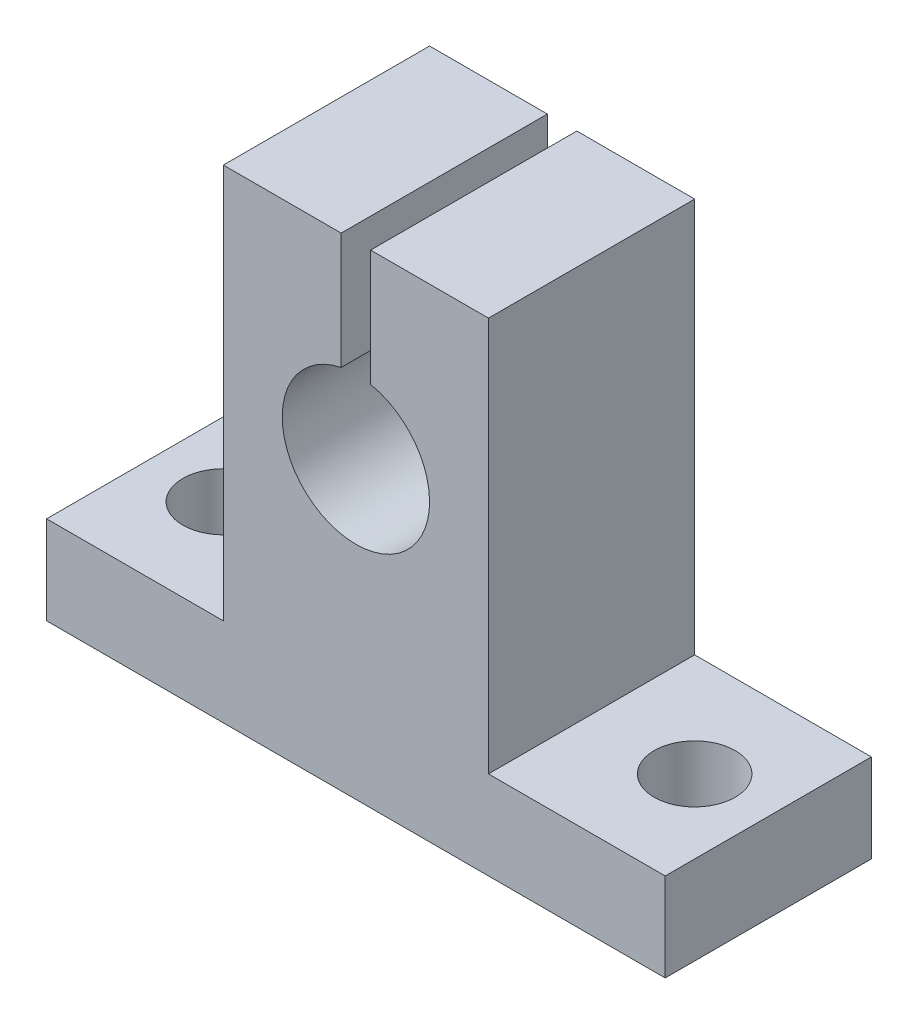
ISO-10303-21;
HEADER;
FILE_DESCRIPTION(('STEP AP214'),'2;1');
FILE_NAME('part.step','',(''),(''),'','','');
FILE_SCHEMA(('AUTOMOTIVE_DESIGN { 1 0 10303 214 1 1 1 1 }'));
ENDSEC;
DATA;
#1=APPLICATION_CONTEXT('core data for automotive mechanical design processes');
#2=APPLICATION_PROTOCOL_DEFINITION('international standard','automotive_design',2000,#1);
#3=PRODUCT_CONTEXT('',#1,'mechanical');
#4=PRODUCT('Part','Part','',(#3));
#5=PRODUCT_RELATED_PRODUCT_CATEGORY('part','',(#4));
#6=PRODUCT_DEFINITION_FORMATION('','',#4);
#7=PRODUCT_DEFINITION_CONTEXT('part definition',#1,'design');
#8=PRODUCT_DEFINITION('design','',#6,#7);
#9=PRODUCT_DEFINITION_SHAPE('','',#8);
#10=(LENGTH_UNIT() NAMED_UNIT(*) SI_UNIT(.MILLI.,.METRE.));
#11=(NAMED_UNIT(*) PLANE_ANGLE_UNIT() SI_UNIT($,.RADIAN.));
#12=(NAMED_UNIT(*) SI_UNIT($,.STERADIAN.) SOLID_ANGLE_UNIT());
#13=UNCERTAINTY_MEASURE_WITH_UNIT(LENGTH_MEASURE(1.E-05),#10,'distance_accuracy_value','');
#14=(GEOMETRIC_REPRESENTATION_CONTEXT(3) GLOBAL_UNCERTAINTY_ASSIGNED_CONTEXT((#13)) GLOBAL_UNIT_ASSIGNED_CONTEXT((#10,
#11,#12)) REPRESENTATION_CONTEXT('',''));
#15=CARTESIAN_POINT('',(0.,0.,0.));
#16=DIRECTION('',(0.,0.,1.));
#17=DIRECTION('',(1.,0.,0.));
#18=AXIS2_PLACEMENT_3D('',#15,#16,#17);
#19=CARTESIAN_POINT('',(21.,12.8,-7.));
#20=DIRECTION('',(0.,1.,0.));
#21=DIRECTION('',(-1.,0.,0.));
#22=AXIS2_PLACEMENT_3D('',#19,#20,#21);
#23=PLANE('',#22);
#24=DIRECTION('',(0.,0.,-1.));
#25=VECTOR('',#24,1.);
#26=CARTESIAN_POINT('',(-1.,12.8,7.));
#27=LINE('',#26,#25);
#28=CARTESIAN_POINT('',(-1.,12.8,7.));
#29=VERTEX_POINT('',#28);
#30=CARTESIAN_POINT('',(-1.,12.8,-7.));
#31=VERTEX_POINT('',#30);
#32=EDGE_CURVE('E141',#29,#31,#27,.T.);
#33=ORIENTED_EDGE('',*,*,#32,.T.);
#34=DIRECTION('',(-1.,0.,0.));
#35=VECTOR('',#34,1.);
#36=CARTESIAN_POINT('',(21.,12.8,-7.));
#37=LINE('',#36,#35);
#38=CARTESIAN_POINT('',(-9.,12.8,-7.));
#39=VERTEX_POINT('',#38);
#40=EDGE_CURVE('E193',#31,#39,#37,.T.);
#41=ORIENTED_EDGE('',*,*,#40,.T.);
#42=DIRECTION('',(0.,0.,-1.));
#43=VECTOR('',#42,1.);
#44=CARTESIAN_POINT('',(-9.,12.8,7.));
#45=LINE('',#44,#43);
#46=CARTESIAN_POINT('',(-9.,12.8,7.));
#47=VERTEX_POINT('',#46);
#48=EDGE_CURVE('E178',#47,#39,#45,.T.);
#49=ORIENTED_EDGE('',*,*,#48,.F.);
#50=DIRECTION('',(-1.,0.,0.));
#51=VECTOR('',#50,1.);
#52=CARTESIAN_POINT('',(21.,12.8,7.));
#53=LINE('',#52,#51);
#54=EDGE_CURVE('E205',#29,#47,#53,.T.);
#55=ORIENTED_EDGE('',*,*,#54,.F.);
#56=EDGE_LOOP('',(#33,#41,#49,#55));
#57=FACE_BOUND('',#56,.T.);
#58=ADVANCED_FACE('F32',(#57),#23,.T.);
#59=CARTESIAN_POINT('',(21.,-20.,-7.));
#60=DIRECTION('',(1.,0.,0.));
#61=DIRECTION('',(0.,1.,0.));
#62=AXIS2_PLACEMENT_3D('',#59,#60,#61);
#63=PLANE('',#62);
#64=DIRECTION('',(0.,0.,-1.));
#65=VECTOR('',#64,1.);
#66=CARTESIAN_POINT('',(21.,-14.,7.));
#67=LINE('',#66,#65);
#68=CARTESIAN_POINT('',(21.,-14.,7.));
#69=VERTEX_POINT('',#68);
#70=CARTESIAN_POINT('',(21.,-14.,-7.));
#71=VERTEX_POINT('',#70);
#72=EDGE_CURVE('E160',#69,#71,#67,.T.);
#73=ORIENTED_EDGE('',*,*,#72,.F.);
#74=DIRECTION('',(0.,1.,0.));
#75=VECTOR('',#74,1.);
#76=CARTESIAN_POINT('',(21.,-20.,7.));
#77=LINE('',#76,#75);
#78=CARTESIAN_POINT('',(21.,-20.,7.));
#79=VERTEX_POINT('',#78);
#80=EDGE_CURVE('E185',#79,#69,#77,.T.);
#81=ORIENTED_EDGE('',*,*,#80,.F.);
#82=DIRECTION('',(0.,0.,1.));
#83=VECTOR('',#82,1.);
#84=CARTESIAN_POINT('',(21.,-20.,-7.));
#85=LINE('',#84,#83);
#86=CARTESIAN_POINT('',(21.,-20.,-7.));
#87=VERTEX_POINT('',#86);
#88=EDGE_CURVE('E11',#87,#79,#85,.T.);
#89=ORIENTED_EDGE('',*,*,#88,.F.);
#90=DIRECTION('',(0.,1.,0.));
#91=VECTOR('',#90,1.);
#92=CARTESIAN_POINT('',(21.,-20.,-7.));
#93=LINE('',#92,#91);
#94=EDGE_CURVE('E190',#87,#71,#93,.T.);
#95=ORIENTED_EDGE('',*,*,#94,.T.);
#96=EDGE_LOOP('',(#73,#81,#89,#95));
#97=FACE_BOUND('',#96,.T.);
#98=ADVANCED_FACE('F34',(#97),#63,.T.);
#99=CARTESIAN_POINT('',(-21.,-20.,-7.));
#100=DIRECTION('',(0.,-1.,0.));
#101=DIRECTION('',(1.,0.,0.));
#102=AXIS2_PLACEMENT_3D('',#99,#100,#101);
#103=PLANE('',#102);
#104=CARTESIAN_POINT('',(-16.,-20.,0.));
#105=DIRECTION('',(0.,1.,0.));
#106=DIRECTION('',(0.,0.,1.));
#107=AXIS2_PLACEMENT_3D('',#104,#105,#106);
#108=CIRCLE('',#107,2.74999999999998);
#109=CARTESIAN_POINT('',(-16.,-20.,2.74999999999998));
#110=VERTEX_POINT('',#109);
#111=EDGE_CURVE('E298',#110,#110,#108,.T.);
#112=ORIENTED_EDGE('',*,*,#111,.T.);
#113=EDGE_LOOP('',(#112));
#114=FACE_BOUND('',#113,.T.);
#115=CARTESIAN_POINT('',(16.,-20.,0.));
#116=DIRECTION('',(0.,-1.,0.));
#117=DIRECTION('',(0.,0.,-1.));
#118=AXIS2_PLACEMENT_3D('',#115,#116,#117);
#119=CIRCLE('',#118,2.74999999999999);
#120=CARTESIAN_POINT('',(16.,-20.,-2.74999999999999));
#121=VERTEX_POINT('',#120);
#122=EDGE_CURVE('E303',#121,#121,#119,.T.);
#123=ORIENTED_EDGE('',*,*,#122,.F.);
#124=EDGE_LOOP('',(#123));
#125=FACE_BOUND('',#124,.T.);
#126=DIRECTION('',(1.,0.,0.));
#127=VECTOR('',#126,1.);
#128=CARTESIAN_POINT('',(-21.,-20.,7.));
#129=LINE('',#128,#127);
#130=CARTESIAN_POINT('',(-21.,-20.,7.));
#131=VERTEX_POINT('',#130);
#132=EDGE_CURVE('E194',#131,#79,#129,.T.);
#133=ORIENTED_EDGE('',*,*,#132,.F.);
#134=DIRECTION('',(0.,0.,1.));
#135=VECTOR('',#134,1.);
#136=CARTESIAN_POINT('',(-21.,-20.,-7.));
#137=LINE('',#136,#135);
#138=CARTESIAN_POINT('',(-21.,-20.,-7.));
#139=VERTEX_POINT('',#138);
#140=EDGE_CURVE('E41',#139,#131,#137,.T.);
#141=ORIENTED_EDGE('',*,*,#140,.F.);
#142=DIRECTION('',(1.,0.,0.));
#143=VECTOR('',#142,1.);
#144=CARTESIAN_POINT('',(-21.,-20.,-7.));
#145=LINE('',#144,#143);
#146=EDGE_CURVE('E200',#139,#87,#145,.T.);
#147=ORIENTED_EDGE('',*,*,#146,.T.);
#148=ORIENTED_EDGE('',*,*,#88,.T.);
#149=EDGE_LOOP('',(#133,#141,#147,#148));
#150=FACE_BOUND('',#149,.T.);
#151=ADVANCED_FACE('F220',(#114,#125,#150),#103,.T.);
#152=CARTESIAN_POINT('',(-21.,12.8,-7.));
#153=DIRECTION('',(-1.,0.,0.));
#154=DIRECTION('',(0.,0.,1.));
#155=AXIS2_PLACEMENT_3D('',#152,#153,#154);
#156=PLANE('',#155);
#157=DIRECTION('',(0.,0.,-1.));
#158=VECTOR('',#157,1.);
#159=CARTESIAN_POINT('',(-21.,-14.,7.));
#160=LINE('',#159,#158);
#161=CARTESIAN_POINT('',(-21.,-14.,7.));
#162=VERTEX_POINT('',#161);
#163=CARTESIAN_POINT('',(-21.,-14.,-7.));
#164=VERTEX_POINT('',#163);
#165=EDGE_CURVE('E182',#162,#164,#160,.T.);
#166=ORIENTED_EDGE('',*,*,#165,.T.);
#167=DIRECTION('',(0.,-1.,0.));
#168=VECTOR('',#167,1.);
#169=CARTESIAN_POINT('',(-21.,12.8,-7.));
#170=LINE('',#169,#168);
#171=EDGE_CURVE('E198',#164,#139,#170,.T.);
#172=ORIENTED_EDGE('',*,*,#171,.T.);
#173=ORIENTED_EDGE('',*,*,#140,.T.);
#174=DIRECTION('',(0.,-1.,0.));
#175=VECTOR('',#174,1.);
#176=CARTESIAN_POINT('',(-21.,12.8,7.));
#177=LINE('',#176,#175);
#178=EDGE_CURVE('E208',#162,#131,#177,.T.);
#179=ORIENTED_EDGE('',*,*,#178,.F.);
#180=EDGE_LOOP('',(#166,#172,#173,#179));
#181=FACE_BOUND('',#180,.T.);
#182=ADVANCED_FACE('F216',(#181),#156,.T.);
#183=DIRECTION('',(0.,0.,-1.));
#184=VECTOR('',#183,1.);
#185=CARTESIAN_POINT('',(0.999999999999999,12.8,7.));
#186=LINE('',#185,#184);
#187=CARTESIAN_POINT('',(0.999999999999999,12.8,7.));
#188=VERTEX_POINT('',#187);
#189=CARTESIAN_POINT('',(0.999999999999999,12.8,-7.));
#190=VERTEX_POINT('',#189);
#191=EDGE_CURVE('E152',#188,#190,#186,.T.);
#192=ORIENTED_EDGE('',*,*,#191,.F.);
#193=CARTESIAN_POINT('',(9.,12.8,7.));
#194=VERTEX_POINT('',#193);
#195=EDGE_CURVE('E206',#194,#188,#53,.T.);
#196=ORIENTED_EDGE('',*,*,#195,.F.);
#197=DIRECTION('',(0.,0.,-1.));
#198=VECTOR('',#197,1.);
#199=CARTESIAN_POINT('',(9.,12.8,7.));
#200=LINE('',#199,#198);
#201=CARTESIAN_POINT('',(9.,12.8,-7.));
#202=VERTEX_POINT('',#201);
#203=EDGE_CURVE('E164',#194,#202,#200,.T.);
#204=ORIENTED_EDGE('',*,*,#203,.T.);
#205=EDGE_CURVE('E195',#202,#190,#37,.T.);
#206=ORIENTED_EDGE('',*,*,#205,.T.);
#207=EDGE_LOOP('',(#192,#196,#204,#206));
#208=FACE_BOUND('',#207,.T.);
#209=ADVANCED_FACE('F244',(#208),#23,.T.);
#210=CARTESIAN_POINT('',(0.,0.,-7.));
#211=DIRECTION('',(0.,0.,1.));
#212=DIRECTION('',(1.,0.,0.));
#213=AXIS2_PLACEMENT_3D('',#210,#211,#212);
#214=PLANE('',#213);
#215=DIRECTION('',(0.,1.,0.));
#216=VECTOR('',#215,1.);
#217=CARTESIAN_POINT('',(-1.,4.89897948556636,-7.));
#218=LINE('',#217,#216);
#219=CARTESIAN_POINT('',(-1.,4.89897948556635,-7.));
#220=VERTEX_POINT('',#219);
#221=EDGE_CURVE('E146',#220,#31,#218,.T.);
#222=ORIENTED_EDGE('',*,*,#221,.F.);
#223=CARTESIAN_POINT('',(0.,0.,-7.));
#224=DIRECTION('',(0.,0.,1.));
#225=DIRECTION('',(1.,0.,0.));
#226=AXIS2_PLACEMENT_3D('',#223,#224,#225);
#227=CIRCLE('',#226,5.);
#228=CARTESIAN_POINT('',(0.999999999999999,4.89897948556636,-7.));
#229=VERTEX_POINT('',#228);
#230=EDGE_CURVE('E123',#220,#229,#227,.T.);
#231=ORIENTED_EDGE('',*,*,#230,.T.);
#232=DIRECTION('',(0.,-1.,0.));
#233=VECTOR('',#232,1.);
#234=CARTESIAN_POINT('',(0.999999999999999,12.8,-7.));
#235=LINE('',#234,#233);
#236=EDGE_CURVE('E142',#190,#229,#235,.T.);
#237=ORIENTED_EDGE('',*,*,#236,.F.);
#238=ORIENTED_EDGE('',*,*,#205,.F.);
#239=DIRECTION('',(0.,1.,0.));
#240=VECTOR('',#239,1.);
#241=CARTESIAN_POINT('',(9.,-14.,-7.));
#242=LINE('',#241,#240);
#243=CARTESIAN_POINT('',(9.,-14.,-7.));
#244=VERTEX_POINT('',#243);
#245=EDGE_CURVE('E158',#244,#202,#242,.T.);
#246=ORIENTED_EDGE('',*,*,#245,.F.);
#247=DIRECTION('',(-1.,0.,0.));
#248=VECTOR('',#247,1.);
#249=CARTESIAN_POINT('',(21.,-14.,-7.));
#250=LINE('',#249,#248);
#251=EDGE_CURVE('E127',#71,#244,#250,.T.);
#252=ORIENTED_EDGE('',*,*,#251,.F.);
#253=ORIENTED_EDGE('',*,*,#94,.F.);
#254=ORIENTED_EDGE('',*,*,#146,.F.);
#255=ORIENTED_EDGE('',*,*,#171,.F.);
#256=DIRECTION('',(-1.,0.,0.));
#257=VECTOR('',#256,1.);
#258=CARTESIAN_POINT('',(-9.,-14.,-7.));
#259=LINE('',#258,#257);
#260=CARTESIAN_POINT('',(-9.,-14.,-7.));
#261=VERTEX_POINT('',#260);
#262=EDGE_CURVE('E175',#261,#164,#259,.T.);
#263=ORIENTED_EDGE('',*,*,#262,.F.);
#264=DIRECTION('',(0.,-1.,0.));
#265=VECTOR('',#264,1.);
#266=CARTESIAN_POINT('',(-9.,12.8,-7.));
#267=LINE('',#266,#265);
#268=EDGE_CURVE('E167',#39,#261,#267,.T.);
#269=ORIENTED_EDGE('',*,*,#268,.F.);
#270=ORIENTED_EDGE('',*,*,#40,.F.);
#271=EDGE_LOOP('',(#222,#231,#237,#238,#246,#252,#253,#254,#255,#263,#269,#270));
#272=FACE_BOUND('',#271,.T.);
#273=ADVANCED_FACE('F233',(#272),#214,.F.);
#274=CARTESIAN_POINT('',(0.,0.,7.));
#275=DIRECTION('',(0.,0.,1.));
#276=DIRECTION('',(1.,0.,0.));
#277=AXIS2_PLACEMENT_3D('',#274,#275,#276);
#278=PLANE('',#277);
#279=CARTESIAN_POINT('',(0.,0.,7.));
#280=DIRECTION('',(0.,0.,1.));
#281=DIRECTION('',(1.,0.,0.));
#282=AXIS2_PLACEMENT_3D('',#279,#280,#281);
#283=CIRCLE('',#282,5.);
#284=CARTESIAN_POINT('',(-1.,4.89897948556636,7.));
#285=VERTEX_POINT('',#284);
#286=CARTESIAN_POINT('',(0.999999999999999,4.89897948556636,7.));
#287=VERTEX_POINT('',#286);
#288=EDGE_CURVE('E49',#285,#287,#283,.T.);
#289=ORIENTED_EDGE('',*,*,#288,.F.);
#290=DIRECTION('',(0.,1.,0.));
#291=VECTOR('',#290,1.);
#292=CARTESIAN_POINT('',(-1.,4.89897948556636,7.));
#293=LINE('',#292,#291);
#294=EDGE_CURVE('E134',#285,#29,#293,.T.);
#295=ORIENTED_EDGE('',*,*,#294,.T.);
#296=ORIENTED_EDGE('',*,*,#54,.T.);
#297=DIRECTION('',(0.,-1.,0.));
#298=VECTOR('',#297,1.);
#299=CARTESIAN_POINT('',(-9.,12.8,7.));
#300=LINE('',#299,#298);
#301=CARTESIAN_POINT('',(-9.,-14.,7.));
#302=VERTEX_POINT('',#301);
#303=EDGE_CURVE('E171',#47,#302,#300,.T.);
#304=ORIENTED_EDGE('',*,*,#303,.T.);
#305=DIRECTION('',(-1.,0.,0.));
#306=VECTOR('',#305,1.);
#307=CARTESIAN_POINT('',(-9.,-14.,7.));
#308=LINE('',#307,#306);
#309=EDGE_CURVE('E174',#302,#162,#308,.T.);
#310=ORIENTED_EDGE('',*,*,#309,.T.);
#311=ORIENTED_EDGE('',*,*,#178,.T.);
#312=ORIENTED_EDGE('',*,*,#132,.T.);
#313=ORIENTED_EDGE('',*,*,#80,.T.);
#314=DIRECTION('',(-1.,0.,0.));
#315=VECTOR('',#314,1.);
#316=CARTESIAN_POINT('',(21.,-14.,7.));
#317=LINE('',#316,#315);
#318=CARTESIAN_POINT('',(9.,-14.,7.));
#319=VERTEX_POINT('',#318);
#320=EDGE_CURVE('E155',#69,#319,#317,.T.);
#321=ORIENTED_EDGE('',*,*,#320,.T.);
#322=DIRECTION('',(0.,1.,0.));
#323=VECTOR('',#322,1.);
#324=CARTESIAN_POINT('',(9.,-14.,7.));
#325=LINE('',#324,#323);
#326=EDGE_CURVE('E57',#319,#194,#325,.T.);
#327=ORIENTED_EDGE('',*,*,#326,.T.);
#328=ORIENTED_EDGE('',*,*,#195,.T.);
#329=DIRECTION('',(0.,-1.,0.));
#330=VECTOR('',#329,1.);
#331=CARTESIAN_POINT('',(0.999999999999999,12.8,7.));
#332=LINE('',#331,#330);
#333=EDGE_CURVE('E137',#188,#287,#332,.T.);
#334=ORIENTED_EDGE('',*,*,#333,.T.);
#335=EDGE_LOOP('',(#289,#295,#296,#304,#310,#311,#312,#313,#321,#327,#328,#334));
#336=FACE_BOUND('',#335,.T.);
#337=ADVANCED_FACE('F133',(#336),#278,.T.);
#338=CARTESIAN_POINT('',(-9.,-14.,7.));
#339=DIRECTION('',(0.,-1.,0.));
#340=DIRECTION('',(0.,0.,-1.));
#341=AXIS2_PLACEMENT_3D('',#338,#339,#340);
#342=PLANE('',#341);
#343=CARTESIAN_POINT('',(-16.,-14.,0.));
#344=DIRECTION('',(0.,1.,0.));
#345=DIRECTION('',(0.,0.,1.));
#346=AXIS2_PLACEMENT_3D('',#343,#344,#345);
#347=CIRCLE('',#346,2.74999999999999);
#348=CARTESIAN_POINT('',(-16.,-14.,2.74999999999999));
#349=VERTEX_POINT('',#348);
#350=EDGE_CURVE('E301',#349,#349,#347,.T.);
#351=ORIENTED_EDGE('',*,*,#350,.F.);
#352=EDGE_LOOP('',(#351));
#353=FACE_BOUND('',#352,.T.);
#354=ORIENTED_EDGE('',*,*,#262,.T.);
#355=ORIENTED_EDGE('',*,*,#165,.F.);
#356=ORIENTED_EDGE('',*,*,#309,.F.);
#357=DIRECTION('',(0.,0.,-1.));
#358=VECTOR('',#357,1.);
#359=CARTESIAN_POINT('',(-9.,-14.,7.));
#360=LINE('',#359,#358);
#361=EDGE_CURVE('E186',#302,#261,#360,.T.);
#362=ORIENTED_EDGE('',*,*,#361,.T.);
#363=EDGE_LOOP('',(#354,#355,#356,#362));
#364=FACE_BOUND('',#363,.T.);
#365=ADVANCED_FACE('F225',(#353,#364),#342,.F.);
#366=CARTESIAN_POINT('',(-9.,12.8,7.));
#367=DIRECTION('',(1.,0.,0.));
#368=DIRECTION('',(0.,0.,-1.));
#369=AXIS2_PLACEMENT_3D('',#366,#367,#368);
#370=PLANE('',#369);
#371=ORIENTED_EDGE('',*,*,#268,.T.);
#372=ORIENTED_EDGE('',*,*,#361,.F.);
#373=ORIENTED_EDGE('',*,*,#303,.F.);
#374=ORIENTED_EDGE('',*,*,#48,.T.);
#375=EDGE_LOOP('',(#371,#372,#373,#374));
#376=FACE_BOUND('',#375,.T.);
#377=ADVANCED_FACE('F227',(#376),#370,.F.);
#378=CARTESIAN_POINT('',(9.,-14.,7.));
#379=DIRECTION('',(-1.,0.,0.));
#380=DIRECTION('',(0.,0.,1.));
#381=AXIS2_PLACEMENT_3D('',#378,#379,#380);
#382=PLANE('',#381);
#383=ORIENTED_EDGE('',*,*,#245,.T.);
#384=ORIENTED_EDGE('',*,*,#203,.F.);
#385=ORIENTED_EDGE('',*,*,#326,.F.);
#386=DIRECTION('',(0.,0.,-1.));
#387=VECTOR('',#386,1.);
#388=CARTESIAN_POINT('',(9.,-14.,7.));
#389=LINE('',#388,#387);
#390=EDGE_CURVE('E168',#319,#244,#389,.T.);
#391=ORIENTED_EDGE('',*,*,#390,.T.);
#392=EDGE_LOOP('',(#383,#384,#385,#391));
#393=FACE_BOUND('',#392,.T.);
#394=ADVANCED_FACE('F271',(#393),#382,.F.);
#395=CARTESIAN_POINT('',(21.,-14.,7.));
#396=DIRECTION('',(0.,-1.,0.));
#397=DIRECTION('',(0.,0.,-1.));
#398=AXIS2_PLACEMENT_3D('',#395,#396,#397);
#399=PLANE('',#398);
#400=CARTESIAN_POINT('',(16.,-14.,0.));
#401=DIRECTION('',(0.,-1.,0.));
#402=DIRECTION('',(0.,0.,-1.));
#403=AXIS2_PLACEMENT_3D('',#400,#401,#402);
#404=CIRCLE('',#403,2.74999999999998);
#405=CARTESIAN_POINT('',(16.,-14.,-2.74999999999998));
#406=VERTEX_POINT('',#405);
#407=EDGE_CURVE('E36',#406,#406,#404,.T.);
#408=ORIENTED_EDGE('',*,*,#407,.T.);
#409=EDGE_LOOP('',(#408));
#410=FACE_BOUND('',#409,.T.);
#411=ORIENTED_EDGE('',*,*,#251,.T.);
#412=ORIENTED_EDGE('',*,*,#390,.F.);
#413=ORIENTED_EDGE('',*,*,#320,.F.);
#414=ORIENTED_EDGE('',*,*,#72,.T.);
#415=EDGE_LOOP('',(#411,#412,#413,#414));
#416=FACE_BOUND('',#415,.T.);
#417=ADVANCED_FACE('F240',(#410,#416),#399,.F.);
#418=CARTESIAN_POINT('',(-1.,4.89897948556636,7.));
#419=DIRECTION('',(-1.,0.,0.));
#420=DIRECTION('',(0.,0.,1.));
#421=AXIS2_PLACEMENT_3D('',#418,#419,#420);
#422=PLANE('',#421);
#423=ORIENTED_EDGE('',*,*,#221,.T.);
#424=ORIENTED_EDGE('',*,*,#32,.F.);
#425=ORIENTED_EDGE('',*,*,#294,.F.);
#426=DIRECTION('',(0.,0.,-1.));
#427=VECTOR('',#426,1.);
#428=CARTESIAN_POINT('',(-1.,4.89897948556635,7.));
#429=LINE('',#428,#427);
#430=EDGE_CURVE('E120',#285,#220,#429,.T.);
#431=ORIENTED_EDGE('',*,*,#430,.T.);
#432=EDGE_LOOP('',(#423,#424,#425,#431));
#433=FACE_BOUND('',#432,.T.);
#434=ADVANCED_FACE('F139',(#433),#422,.F.);
#435=CARTESIAN_POINT('',(0.999999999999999,12.8,7.));
#436=DIRECTION('',(1.,0.,0.));
#437=DIRECTION('',(0.,1.,0.));
#438=AXIS2_PLACEMENT_3D('',#435,#436,#437);
#439=PLANE('',#438);
#440=ORIENTED_EDGE('',*,*,#236,.T.);
#441=DIRECTION('',(0.,0.,-1.));
#442=VECTOR('',#441,1.);
#443=CARTESIAN_POINT('',(0.999999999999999,4.89897948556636,7.));
#444=LINE('',#443,#442);
#445=EDGE_CURVE('E128',#287,#229,#444,.T.);
#446=ORIENTED_EDGE('',*,*,#445,.F.);
#447=ORIENTED_EDGE('',*,*,#333,.F.);
#448=ORIENTED_EDGE('',*,*,#191,.T.);
#449=EDGE_LOOP('',(#440,#446,#447,#448));
#450=FACE_BOUND('',#449,.T.);
#451=ADVANCED_FACE('F248',(#450),#439,.F.);
#452=CARTESIAN_POINT('',(0.,0.,-7.));
#453=DIRECTION('',(0.,0.,1.));
#454=DIRECTION('',(1.,0.,0.));
#455=AXIS2_PLACEMENT_3D('',#452,#453,#454);
#456=CYLINDRICAL_SURFACE('',#455,5.);
#457=ORIENTED_EDGE('',*,*,#288,.T.);
#458=ORIENTED_EDGE('',*,*,#445,.T.);
#459=ORIENTED_EDGE('',*,*,#230,.F.);
#460=ORIENTED_EDGE('',*,*,#430,.F.);
#461=EDGE_LOOP('',(#457,#458,#459,#460));
#462=FACE_BOUND('',#461,.T.);
#463=ADVANCED_FACE('F121',(#462),#456,.F.);
#464=CARTESIAN_POINT('',(16.,-20.,0.));
#465=DIRECTION('',(0.,-1.,0.));
#466=DIRECTION('',(0.,0.,-1.));
#467=AXIS2_PLACEMENT_3D('',#464,#465,#466);
#468=CYLINDRICAL_SURFACE('',#467,2.74999999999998);
#469=ORIENTED_EDGE('',*,*,#122,.T.);
#470=EDGE_LOOP('',(#469));
#471=FACE_BOUND('',#470,.T.);
#472=ORIENTED_EDGE('',*,*,#407,.F.);
#473=EDGE_LOOP('',(#472));
#474=FACE_BOUND('',#473,.T.);
#475=ADVANCED_FACE('F286',(#471,#474),#468,.F.);
#476=CARTESIAN_POINT('',(-16.,-14.,0.));
#477=DIRECTION('',(0.,1.,0.));
#478=DIRECTION('',(0.,0.,1.));
#479=AXIS2_PLACEMENT_3D('',#476,#477,#478);
#480=CYLINDRICAL_SURFACE('',#479,2.74999999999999);
#481=ORIENTED_EDGE('',*,*,#111,.F.);
#482=EDGE_LOOP('',(#481));
#483=FACE_BOUND('',#482,.T.);
#484=ORIENTED_EDGE('',*,*,#350,.T.);
#485=EDGE_LOOP('',(#484));
#486=FACE_BOUND('',#485,.T.);
#487=ADVANCED_FACE('F289',(#483,#486),#480,.F.);
#488=CLOSED_SHELL('',(#58,#98,#151,#182,#209,#273,#337,#365,#377,#394,#417,#434,#451,#463,#475,#487));
#489=MANIFOLD_SOLID_BREP('B2',#488);
#490=ADVANCED_BREP_SHAPE_REPRESENTATION('',(#18,#489),#14);
#491=SHAPE_DEFINITION_REPRESENTATION(#9,#490);
ENDSEC;
END-ISO-10303-21;
